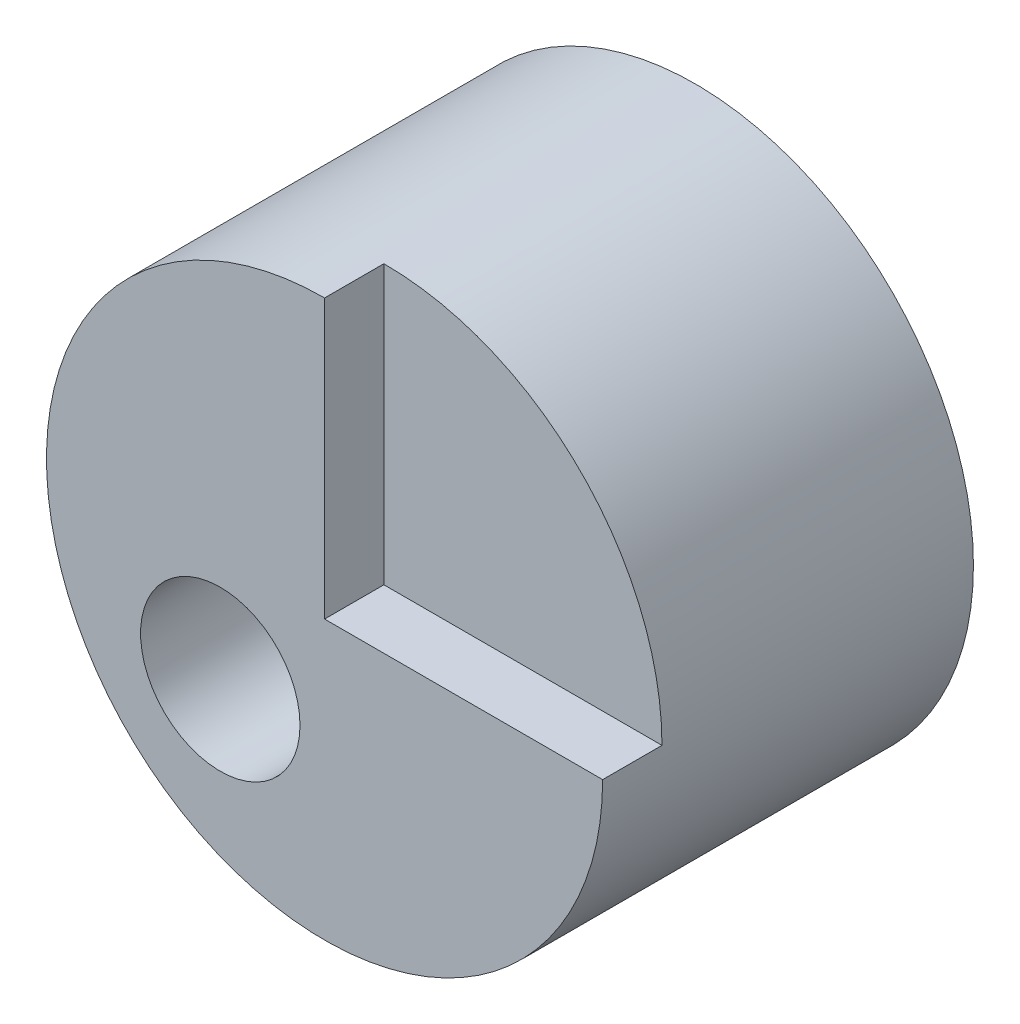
from build123d import *

# Parameters (mm, degrees)
ESQUISSE1_R             = 7.5
BOSS_EXTRU_1_DEPTH      = 10
ESQUISSE3_W             = 8.692072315
ESQUISSE3_H             = 9.474338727
ENL_V_MAT_EXTRU_3_DEPTH = 1.6
ESQUISSE5_R             = 2.15
ENL_V_MAT_EXTRU_4_DEPTH = 26.074275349


with BuildPart() as part:
    # Esquisse1 → Boss.-Extru.1 (new body)
    with BuildSketch(Plane.XY):
        with Locations((-10.638983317, 6.631403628)):
            Circle(ESQUISSE1_R)
    extrude(amount=BOSS_EXTRU_1_DEPTH)

    # Esquisse3 → Enl_v. mat.-Extru.3 (cut)
    with BuildSketch(Plane.XY.offset(10)):
        with Locations((-6.29294716, 11.368572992)):
            Rectangle(ESQUISSE3_W, ESQUISSE3_H)
    extrude(amount=-ENL_V_MAT_EXTRU_3_DEPTH, mode=Mode.SUBTRACT)

    # Esquisse5 → Enl_v. mat.-Extru.4 (cut, through all)
    with BuildSketch(Plane.XY.offset(10)):
        with Locations((-13.451483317, 3.818903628)):
            Circle(ESQUISSE5_R)
    extrude(amount=-ENL_V_MAT_EXTRU_4_DEPTH, mode=Mode.SUBTRACT)


solid = part.part
